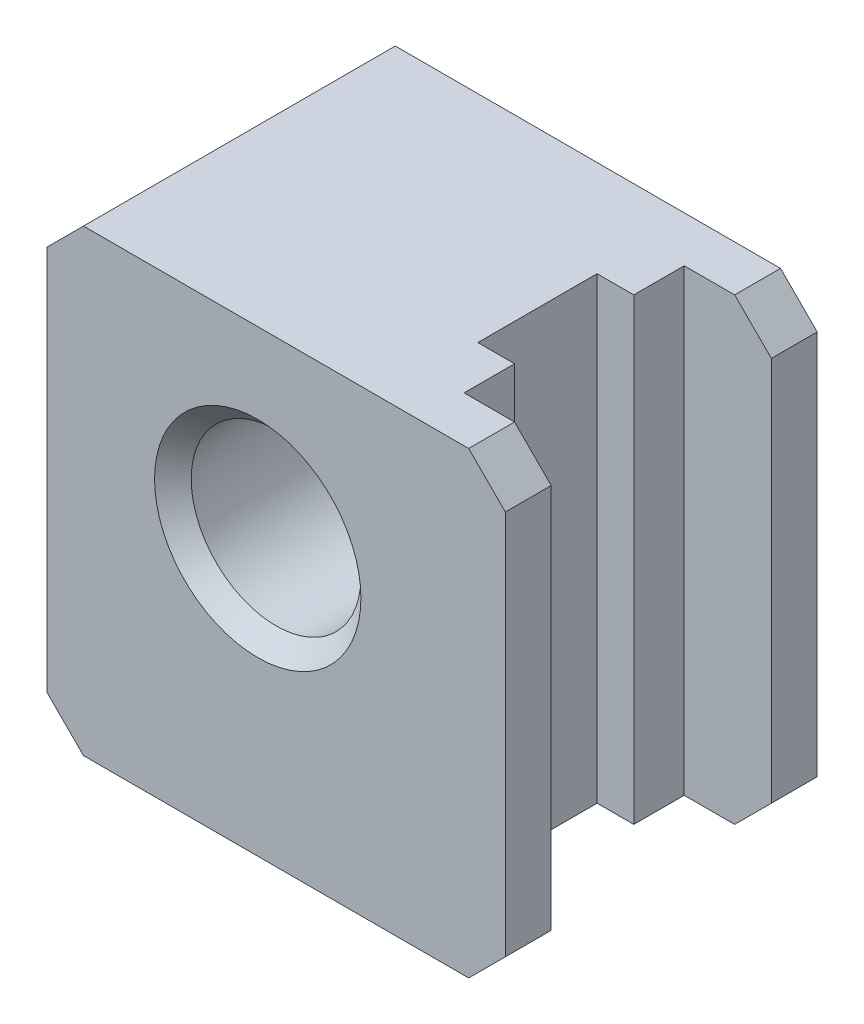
ISO-10303-21;
HEADER;
FILE_DESCRIPTION(('STEP AP214'),'2;1');
FILE_NAME('part.step','',(''),(''),'','','');
FILE_SCHEMA(('AUTOMOTIVE_DESIGN { 1 0 10303 214 1 1 1 1 }'));
ENDSEC;
DATA;
#1=APPLICATION_CONTEXT('core data for automotive mechanical design processes');
#2=APPLICATION_PROTOCOL_DEFINITION('international standard','automotive_design',2000,#1);
#3=PRODUCT_CONTEXT('',#1,'mechanical');
#4=PRODUCT('Part','Part','',(#3));
#5=PRODUCT_RELATED_PRODUCT_CATEGORY('part','',(#4));
#6=PRODUCT_DEFINITION_FORMATION('','',#4);
#7=PRODUCT_DEFINITION_CONTEXT('part definition',#1,'design');
#8=PRODUCT_DEFINITION('design','',#6,#7);
#9=PRODUCT_DEFINITION_SHAPE('','',#8);
#10=(LENGTH_UNIT() NAMED_UNIT(*) SI_UNIT(.MILLI.,.METRE.));
#11=(NAMED_UNIT(*) PLANE_ANGLE_UNIT() SI_UNIT($,.RADIAN.));
#12=(NAMED_UNIT(*) SI_UNIT($,.STERADIAN.) SOLID_ANGLE_UNIT());
#13=UNCERTAINTY_MEASURE_WITH_UNIT(LENGTH_MEASURE(1.E-05),#10,'distance_accuracy_value','');
#14=(GEOMETRIC_REPRESENTATION_CONTEXT(3) GLOBAL_UNCERTAINTY_ASSIGNED_CONTEXT((#13)) GLOBAL_UNIT_ASSIGNED_CONTEXT((#10,
#11,#12)) REPRESENTATION_CONTEXT('',''));
#15=CARTESIAN_POINT('',(0.,0.,0.));
#16=DIRECTION('',(0.,0.,1.));
#17=DIRECTION('',(1.,0.,0.));
#18=AXIS2_PLACEMENT_3D('',#15,#16,#17);
#19=CARTESIAN_POINT('',(15.5,-25.,12.));
#20=DIRECTION('',(1.,0.,0.));
#21=DIRECTION('',(0.,1.,0.));
#22=AXIS2_PLACEMENT_3D('',#19,#20,#21);
#23=PLANE('',#22);
#24=DIRECTION('',(0.,-1.,0.));
#25=VECTOR('',#24,1.);
#26=CARTESIAN_POINT('',(15.5,25.,6.50000000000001));
#27=LINE('',#26,#25);
#28=CARTESIAN_POINT('',(15.5,25.,6.50000000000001));
#29=VERTEX_POINT('',#28);
#30=CARTESIAN_POINT('',(15.5,-25.,6.5));
#31=VERTEX_POINT('',#30);
#32=EDGE_CURVE('E175',#29,#31,#27,.T.);
#33=ORIENTED_EDGE('',*,*,#32,.F.);
#34=DIRECTION('',(0.,0.,1.));
#35=VECTOR('',#34,1.);
#36=CARTESIAN_POINT('',(15.5,25.,12.));
#37=LINE('',#36,#35);
#38=CARTESIAN_POINT('',(15.5,25.,12.));
#39=VERTEX_POINT('',#38);
#40=EDGE_CURVE('E229',#29,#39,#37,.T.);
#41=ORIENTED_EDGE('',*,*,#40,.T.);
#42=DIRECTION('',(0.,-1.,0.));
#43=VECTOR('',#42,1.);
#44=CARTESIAN_POINT('',(15.5,25.,12.));
#45=LINE('',#44,#43);
#46=CARTESIAN_POINT('',(15.5,-25.,12.));
#47=VERTEX_POINT('',#46);
#48=EDGE_CURVE('E217',#39,#47,#45,.T.);
#49=ORIENTED_EDGE('',*,*,#48,.T.);
#50=DIRECTION('',(0.,0.,-1.));
#51=VECTOR('',#50,1.);
#52=CARTESIAN_POINT('',(15.5,-25.,12.));
#53=LINE('',#52,#51);
#54=EDGE_CURVE('E222',#47,#31,#53,.T.);
#55=ORIENTED_EDGE('',*,*,#54,.T.);
#56=EDGE_LOOP('',(#33,#41,#49,#55));
#57=FACE_BOUND('',#56,.T.);
#58=ADVANCED_FACE('F45',(#57),#23,.T.);
#59=CARTESIAN_POINT('',(25.,25.,17.));
#60=DIRECTION('',(-1.,0.,0.));
#61=DIRECTION('',(0.,-1.,0.));
#62=AXIS2_PLACEMENT_3D('',#59,#60,#61);
#63=PLANE('',#62);
#64=DIRECTION('',(0.,0.,-1.));
#65=VECTOR('',#64,1.);
#66=CARTESIAN_POINT('',(25.,-21.,17.));
#67=LINE('',#66,#65);
#68=CARTESIAN_POINT('',(25.,-21.,17.));
#69=VERTEX_POINT('',#68);
#70=CARTESIAN_POINT('',(25.,-21.,12.));
#71=VERTEX_POINT('',#70);
#72=EDGE_CURVE('E312',#69,#71,#67,.T.);
#73=ORIENTED_EDGE('',*,*,#72,.T.);
#74=DIRECTION('',(0.,-1.,0.));
#75=VECTOR('',#74,1.);
#76=CARTESIAN_POINT('',(25.,25.,12.));
#77=LINE('',#76,#75);
#78=CARTESIAN_POINT('',(25.,21.,12.));
#79=VERTEX_POINT('',#78);
#80=EDGE_CURVE('E210',#79,#71,#77,.T.);
#81=ORIENTED_EDGE('',*,*,#80,.F.);
#82=DIRECTION('',(0.,0.,1.));
#83=VECTOR('',#82,1.);
#84=CARTESIAN_POINT('',(25.,21.,17.));
#85=LINE('',#84,#83);
#86=CARTESIAN_POINT('',(25.,21.,17.));
#87=VERTEX_POINT('',#86);
#88=EDGE_CURVE('E306',#79,#87,#85,.T.);
#89=ORIENTED_EDGE('',*,*,#88,.T.);
#90=DIRECTION('',(0.,1.,0.));
#91=VECTOR('',#90,1.);
#92=CARTESIAN_POINT('',(25.,25.,17.));
#93=LINE('',#92,#91);
#94=EDGE_CURVE('E268',#69,#87,#93,.T.);
#95=ORIENTED_EDGE('',*,*,#94,.F.);
#96=EDGE_LOOP('',(#73,#81,#89,#95));
#97=FACE_BOUND('',#96,.T.);
#98=ADVANCED_FACE('F423',(#97),#63,.F.);
#99=CARTESIAN_POINT('',(25.,-21.,17.));
#100=DIRECTION('',(-0.707106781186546,0.707106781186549,0.));
#101=DIRECTION('',(-0.707106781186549,-0.707106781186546,0.));
#102=AXIS2_PLACEMENT_3D('',#99,#100,#101);
#103=PLANE('',#102);
#104=DIRECTION('',(0.707106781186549,0.707106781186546,0.));
#105=VECTOR('',#104,1.);
#106=CARTESIAN_POINT('',(25.,-21.,12.));
#107=LINE('',#106,#105);
#108=CARTESIAN_POINT('',(21.,-25.,12.));
#109=VERTEX_POINT('',#108);
#110=EDGE_CURVE('E255',#71,#109,#107,.F.);
#111=ORIENTED_EDGE('',*,*,#110,.F.);
#112=ORIENTED_EDGE('',*,*,#72,.F.);
#113=DIRECTION('',(-0.707106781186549,-0.707106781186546,0.));
#114=VECTOR('',#113,1.);
#115=CARTESIAN_POINT('',(-2.00000000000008,-48.,17.));
#116=LINE('',#115,#114);
#117=CARTESIAN_POINT('',(21.,-25.,17.));
#118=VERTEX_POINT('',#117);
#119=EDGE_CURVE('E346',#118,#69,#116,.F.);
#120=ORIENTED_EDGE('',*,*,#119,.F.);
#121=DIRECTION('',(0.,0.,1.));
#122=VECTOR('',#121,1.);
#123=CARTESIAN_POINT('',(21.,-25.,17.));
#124=LINE('',#123,#122);
#125=EDGE_CURVE('E332',#109,#118,#124,.T.);
#126=ORIENTED_EDGE('',*,*,#125,.F.);
#127=EDGE_LOOP('',(#111,#112,#120,#126));
#128=FACE_BOUND('',#127,.T.);
#129=ADVANCED_FACE('F418',(#128),#103,.F.);
#130=CARTESIAN_POINT('',(21.,25.,17.));
#131=DIRECTION('',(-0.707106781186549,-0.707106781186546,0.));
#132=DIRECTION('',(0.707106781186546,-0.707106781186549,0.));
#133=AXIS2_PLACEMENT_3D('',#130,#131,#132);
#134=PLANE('',#133);
#135=DIRECTION('',(-0.707106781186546,0.707106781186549,0.));
#136=VECTOR('',#135,1.);
#137=CARTESIAN_POINT('',(21.,25.,12.));
#138=LINE('',#137,#136);
#139=CARTESIAN_POINT('',(21.,25.,12.));
#140=VERTEX_POINT('',#139);
#141=EDGE_CURVE('E11',#140,#79,#138,.F.);
#142=ORIENTED_EDGE('',*,*,#141,.F.);
#143=DIRECTION('',(0.,0.,-1.));
#144=VECTOR('',#143,1.);
#145=CARTESIAN_POINT('',(21.,25.,17.));
#146=LINE('',#145,#144);
#147=CARTESIAN_POINT('',(21.,25.,17.));
#148=VERTEX_POINT('',#147);
#149=EDGE_CURVE('E357',#148,#140,#146,.T.);
#150=ORIENTED_EDGE('',*,*,#149,.F.);
#151=DIRECTION('',(0.707106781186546,-0.707106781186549,0.));
#152=VECTOR('',#151,1.);
#153=CARTESIAN_POINT('',(23.0000000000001,22.9999999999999,17.));
#154=LINE('',#153,#152);
#155=EDGE_CURVE('E337',#87,#148,#154,.F.);
#156=ORIENTED_EDGE('',*,*,#155,.F.);
#157=ORIENTED_EDGE('',*,*,#88,.F.);
#158=EDGE_LOOP('',(#142,#150,#156,#157));
#159=FACE_BOUND('',#158,.T.);
#160=ADVANCED_FACE('F428',(#159),#134,.F.);
#161=CARTESIAN_POINT('',(-25.,25.,17.));
#162=DIRECTION('',(1.,0.,0.));
#163=DIRECTION('',(0.,1.,0.));
#164=AXIS2_PLACEMENT_3D('',#161,#162,#163);
#165=PLANE('',#164);
#166=DIRECTION('',(0.,-1.,0.));
#167=VECTOR('',#166,1.);
#168=CARTESIAN_POINT('',(-25.,25.,-17.));
#169=LINE('',#168,#167);
#170=CARTESIAN_POINT('',(-25.,21.,-17.));
#171=VERTEX_POINT('',#170);
#172=CARTESIAN_POINT('',(-25.,-21.,-17.));
#173=VERTEX_POINT('',#172);
#174=EDGE_CURVE('E258',#171,#173,#169,.T.);
#175=ORIENTED_EDGE('',*,*,#174,.T.);
#176=DIRECTION('',(0.,0.,1.));
#177=VECTOR('',#176,1.);
#178=CARTESIAN_POINT('',(-25.,-21.,17.));
#179=LINE('',#178,#177);
#180=CARTESIAN_POINT('',(-25.,-21.,17.));
#181=VERTEX_POINT('',#180);
#182=EDGE_CURVE('E353',#173,#181,#179,.T.);
#183=ORIENTED_EDGE('',*,*,#182,.T.);
#184=DIRECTION('',(0.,-1.,0.));
#185=VECTOR('',#184,1.);
#186=CARTESIAN_POINT('',(-25.,25.,17.));
#187=LINE('',#186,#185);
#188=CARTESIAN_POINT('',(-25.,21.,17.));
#189=VERTEX_POINT('',#188);
#190=EDGE_CURVE('E259',#189,#181,#187,.T.);
#191=ORIENTED_EDGE('',*,*,#190,.F.);
#192=DIRECTION('',(0.,0.,-1.));
#193=VECTOR('',#192,1.);
#194=CARTESIAN_POINT('',(-25.,21.,17.));
#195=LINE('',#194,#193);
#196=EDGE_CURVE('E349',#189,#171,#195,.T.);
#197=ORIENTED_EDGE('',*,*,#196,.T.);
#198=EDGE_LOOP('',(#175,#183,#191,#197));
#199=FACE_BOUND('',#198,.T.);
#200=ADVANCED_FACE('F408',(#199),#165,.F.);
#201=CARTESIAN_POINT('',(-25.,-25.,17.));
#202=DIRECTION('',(0.,1.,0.));
#203=DIRECTION('',(0.,0.,1.));
#204=AXIS2_PLACEMENT_3D('',#201,#202,#203);
#205=PLANE('',#204);
#206=DIRECTION('',(0.,0.,-1.));
#207=VECTOR('',#206,1.);
#208=CARTESIAN_POINT('',(11.5,-25.,6.5));
#209=LINE('',#208,#207);
#210=CARTESIAN_POINT('',(11.5,-25.,6.5));
#211=VERTEX_POINT('',#210);
#212=CARTESIAN_POINT('',(11.5,-25.,-6.50000000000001));
#213=VERTEX_POINT('',#212);
#214=EDGE_CURVE('E187',#211,#213,#209,.T.);
#215=ORIENTED_EDGE('',*,*,#214,.F.);
#216=DIRECTION('',(1.,0.,0.));
#217=VECTOR('',#216,1.);
#218=CARTESIAN_POINT('',(11.5,-25.,6.5));
#219=LINE('',#218,#217);
#220=EDGE_CURVE('E169',#211,#31,#219,.T.);
#221=ORIENTED_EDGE('',*,*,#220,.T.);
#222=ORIENTED_EDGE('',*,*,#54,.F.);
#223=DIRECTION('',(1.,0.,0.));
#224=VECTOR('',#223,1.);
#225=CARTESIAN_POINT('',(15.5,-25.,12.));
#226=LINE('',#225,#224);
#227=EDGE_CURVE('E234',#47,#109,#226,.T.);
#228=ORIENTED_EDGE('',*,*,#227,.T.);
#229=ORIENTED_EDGE('',*,*,#125,.T.);
#230=DIRECTION('',(1.,0.,0.));
#231=VECTOR('',#230,1.);
#232=CARTESIAN_POINT('',(-25.,-25.,17.));
#233=LINE('',#232,#231);
#234=CARTESIAN_POINT('',(-21.,-25.,17.));
#235=VERTEX_POINT('',#234);
#236=EDGE_CURVE('E263',#235,#118,#233,.T.);
#237=ORIENTED_EDGE('',*,*,#236,.F.);
#238=DIRECTION('',(0.,0.,-1.));
#239=VECTOR('',#238,1.);
#240=CARTESIAN_POINT('',(-21.,-25.,17.));
#241=LINE('',#240,#239);
#242=CARTESIAN_POINT('',(-21.,-25.,-17.));
#243=VERTEX_POINT('',#242);
#244=EDGE_CURVE('E328',#235,#243,#241,.T.);
#245=ORIENTED_EDGE('',*,*,#244,.T.);
#246=DIRECTION('',(1.,0.,0.));
#247=VECTOR('',#246,1.);
#248=CARTESIAN_POINT('',(-25.,-25.,-17.));
#249=LINE('',#248,#247);
#250=CARTESIAN_POINT('',(21.,-25.,-17.));
#251=VERTEX_POINT('',#250);
#252=EDGE_CURVE('E280',#243,#251,#249,.T.);
#253=ORIENTED_EDGE('',*,*,#252,.T.);
#254=CARTESIAN_POINT('',(21.,-25.,-12.));
#255=VERTEX_POINT('',#254);
#256=EDGE_CURVE('E333',#251,#255,#124,.T.);
#257=ORIENTED_EDGE('',*,*,#256,.T.);
#258=DIRECTION('',(1.,0.,0.));
#259=VECTOR('',#258,1.);
#260=CARTESIAN_POINT('',(15.5,-25.,-12.));
#261=LINE('',#260,#259);
#262=CARTESIAN_POINT('',(15.5,-25.,-12.));
#263=VERTEX_POINT('',#262);
#264=EDGE_CURVE('E247',#263,#255,#261,.T.);
#265=ORIENTED_EDGE('',*,*,#264,.F.);
#266=CARTESIAN_POINT('',(15.5,-25.,-6.50000000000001));
#267=VERTEX_POINT('',#266);
#268=EDGE_CURVE('E221',#267,#263,#53,.T.);
#269=ORIENTED_EDGE('',*,*,#268,.F.);
#270=DIRECTION('',(1.,0.,0.));
#271=VECTOR('',#270,1.);
#272=CARTESIAN_POINT('',(11.5,-25.,-6.50000000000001));
#273=LINE('',#272,#271);
#274=EDGE_CURVE('E61',#213,#267,#273,.T.);
#275=ORIENTED_EDGE('',*,*,#274,.F.);
#276=EDGE_LOOP('',(#215,#221,#222,#228,#229,#237,#245,#253,#257,#265,#269,#275));
#277=FACE_BOUND('',#276,.T.);
#278=ADVANCED_FACE('F193',(#277),#205,.F.);
#279=CARTESIAN_POINT('',(25.,21.,-17.));
#280=VERTEX_POINT('',#279);
#281=CARTESIAN_POINT('',(25.,21.,-12.));
#282=VERTEX_POINT('',#281);
#283=EDGE_CURVE('E307',#280,#282,#85,.T.);
#284=ORIENTED_EDGE('',*,*,#283,.T.);
#285=DIRECTION('',(0.,1.,0.));
#286=VECTOR('',#285,1.);
#287=CARTESIAN_POINT('',(25.,25.,-12.));
#288=LINE('',#287,#286);
#289=CARTESIAN_POINT('',(25.,-21.,-12.));
#290=VERTEX_POINT('',#289);
#291=EDGE_CURVE('E69',#290,#282,#288,.T.);
#292=ORIENTED_EDGE('',*,*,#291,.F.);
#293=CARTESIAN_POINT('',(25.,-21.,-17.));
#294=VERTEX_POINT('',#293);
#295=EDGE_CURVE('E311',#290,#294,#67,.T.);
#296=ORIENTED_EDGE('',*,*,#295,.T.);
#297=DIRECTION('',(0.,1.,0.));
#298=VECTOR('',#297,1.);
#299=CARTESIAN_POINT('',(25.,25.,-17.));
#300=LINE('',#299,#298);
#301=EDGE_CURVE('E284',#294,#280,#300,.T.);
#302=ORIENTED_EDGE('',*,*,#301,.T.);
#303=EDGE_LOOP('',(#284,#292,#296,#302));
#304=FACE_BOUND('',#303,.T.);
#305=ADVANCED_FACE('F393',(#304),#63,.F.);
#306=CARTESIAN_POINT('',(-25.,25.,17.));
#307=DIRECTION('',(0.,-1.,0.));
#308=DIRECTION('',(0.,0.,-1.));
#309=AXIS2_PLACEMENT_3D('',#306,#307,#308);
#310=PLANE('',#309);
#311=ORIENTED_EDGE('',*,*,#40,.F.);
#312=DIRECTION('',(1.,0.,0.));
#313=VECTOR('',#312,1.);
#314=CARTESIAN_POINT('',(11.5,25.,6.50000000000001));
#315=LINE('',#314,#313);
#316=CARTESIAN_POINT('',(11.5,25.,6.50000000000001));
#317=VERTEX_POINT('',#316);
#318=EDGE_CURVE('E207',#317,#29,#315,.T.);
#319=ORIENTED_EDGE('',*,*,#318,.F.);
#320=DIRECTION('',(0.,0.,1.));
#321=VECTOR('',#320,1.);
#322=CARTESIAN_POINT('',(11.5,25.,6.50000000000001));
#323=LINE('',#322,#321);
#324=CARTESIAN_POINT('',(11.5,25.,-6.5));
#325=VERTEX_POINT('',#324);
#326=EDGE_CURVE('E181',#325,#317,#323,.T.);
#327=ORIENTED_EDGE('',*,*,#326,.F.);
#328=DIRECTION('',(1.,0.,0.));
#329=VECTOR('',#328,1.);
#330=CARTESIAN_POINT('',(11.5,25.,-6.5));
#331=LINE('',#330,#329);
#332=CARTESIAN_POINT('',(15.5,25.,-6.5));
#333=VERTEX_POINT('',#332);
#334=EDGE_CURVE('E211',#325,#333,#331,.T.);
#335=ORIENTED_EDGE('',*,*,#334,.T.);
#336=CARTESIAN_POINT('',(15.5,25.,-12.));
#337=VERTEX_POINT('',#336);
#338=EDGE_CURVE('E230',#337,#333,#37,.T.);
#339=ORIENTED_EDGE('',*,*,#338,.F.);
#340=DIRECTION('',(1.,0.,0.));
#341=VECTOR('',#340,1.);
#342=CARTESIAN_POINT('',(15.5,25.,-12.));
#343=LINE('',#342,#341);
#344=CARTESIAN_POINT('',(21.,25.,-12.));
#345=VERTEX_POINT('',#344);
#346=EDGE_CURVE('E243',#337,#345,#343,.T.);
#347=ORIENTED_EDGE('',*,*,#346,.T.);
#348=CARTESIAN_POINT('',(21.,25.,-17.));
#349=VERTEX_POINT('',#348);
#350=EDGE_CURVE('E356',#345,#349,#146,.T.);
#351=ORIENTED_EDGE('',*,*,#350,.T.);
#352=DIRECTION('',(-1.,0.,0.));
#353=VECTOR('',#352,1.);
#354=CARTESIAN_POINT('',(-25.,25.,-17.));
#355=LINE('',#354,#353);
#356=CARTESIAN_POINT('',(-21.,25.,-17.));
#357=VERTEX_POINT('',#356);
#358=EDGE_CURVE('E264',#349,#357,#355,.T.);
#359=ORIENTED_EDGE('',*,*,#358,.T.);
#360=DIRECTION('',(0.,0.,1.));
#361=VECTOR('',#360,1.);
#362=CARTESIAN_POINT('',(-21.,25.,17.));
#363=LINE('',#362,#361);
#364=CARTESIAN_POINT('',(-21.,25.,17.));
#365=VERTEX_POINT('',#364);
#366=EDGE_CURVE('E361',#357,#365,#363,.T.);
#367=ORIENTED_EDGE('',*,*,#366,.T.);
#368=DIRECTION('',(-1.,0.,0.));
#369=VECTOR('',#368,1.);
#370=CARTESIAN_POINT('',(-25.,25.,17.));
#371=LINE('',#370,#369);
#372=EDGE_CURVE('E272',#148,#365,#371,.T.);
#373=ORIENTED_EDGE('',*,*,#372,.F.);
#374=ORIENTED_EDGE('',*,*,#149,.T.);
#375=DIRECTION('',(1.,0.,0.));
#376=VECTOR('',#375,1.);
#377=CARTESIAN_POINT('',(15.5,25.,12.));
#378=LINE('',#377,#376);
#379=EDGE_CURVE('E239',#39,#140,#378,.T.);
#380=ORIENTED_EDGE('',*,*,#379,.F.);
#381=EDGE_LOOP('',(#311,#319,#327,#335,#339,#347,#351,#359,#367,#373,#374,#380));
#382=FACE_BOUND('',#381,.T.);
#383=ADVANCED_FACE('F372',(#382),#310,.F.);
#384=CARTESIAN_POINT('',(-25.,-25.,17.));
#385=DIRECTION('',(0.,0.,1.));
#386=DIRECTION('',(1.,0.,0.));
#387=AXIS2_PLACEMENT_3D('',#384,#385,#386);
#388=PLANE('',#387);
#389=CARTESIAN_POINT('',(-1.99999999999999,5.,17.));
#390=DIRECTION('',(0.,0.,1.));
#391=DIRECTION('',(1.,0.,0.));
#392=AXIS2_PLACEMENT_3D('',#389,#390,#391);
#393=CIRCLE('',#392,11.25);
#394=CARTESIAN_POINT('',(9.25000000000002,5.,17.));
#395=VERTEX_POINT('',#394);
#396=EDGE_CURVE('E298',#395,#395,#393,.F.);
#397=ORIENTED_EDGE('',*,*,#396,.T.);
#398=EDGE_LOOP('',(#397));
#399=FACE_BOUND('',#398,.T.);
#400=ORIENTED_EDGE('',*,*,#236,.T.);
#401=ORIENTED_EDGE('',*,*,#119,.T.);
#402=ORIENTED_EDGE('',*,*,#94,.T.);
#403=ORIENTED_EDGE('',*,*,#155,.T.);
#404=ORIENTED_EDGE('',*,*,#372,.T.);
#405=DIRECTION('',(0.707106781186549,0.707106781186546,0.));
#406=VECTOR('',#405,1.);
#407=CARTESIAN_POINT('',(-48.,-1.9999999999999,17.));
#408=LINE('',#407,#406);
#409=EDGE_CURVE('E340',#365,#189,#408,.F.);
#410=ORIENTED_EDGE('',*,*,#409,.T.);
#411=ORIENTED_EDGE('',*,*,#190,.T.);
#412=DIRECTION('',(-0.707106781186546,0.707106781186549,0.));
#413=VECTOR('',#412,1.);
#414=CARTESIAN_POINT('',(-23.,-23.,17.));
#415=LINE('',#414,#413);
#416=EDGE_CURVE('E343',#181,#235,#415,.F.);
#417=ORIENTED_EDGE('',*,*,#416,.T.);
#418=EDGE_LOOP('',(#400,#401,#402,#403,#404,#410,#411,#417));
#419=FACE_BOUND('',#418,.T.);
#420=ADVANCED_FACE('F405',(#399,#419),#388,.T.);
#421=CARTESIAN_POINT('',(-25.,-25.,-17.));
#422=DIRECTION('',(0.,0.,1.));
#423=DIRECTION('',(1.,0.,0.));
#424=AXIS2_PLACEMENT_3D('',#421,#422,#423);
#425=PLANE('',#424);
#426=CARTESIAN_POINT('',(-1.99999999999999,5.,-17.));
#427=DIRECTION('',(0.,0.,1.));
#428=DIRECTION('',(1.,0.,0.));
#429=AXIS2_PLACEMENT_3D('',#426,#427,#428);
#430=CIRCLE('',#429,11.25);
#431=CARTESIAN_POINT('',(9.24999999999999,5.,-17.));
#432=VERTEX_POINT('',#431);
#433=EDGE_CURVE('E302',#432,#432,#430,.T.);
#434=ORIENTED_EDGE('',*,*,#433,.T.);
#435=EDGE_LOOP('',(#434));
#436=FACE_BOUND('',#435,.T.);
#437=ORIENTED_EDGE('',*,*,#301,.F.);
#438=DIRECTION('',(0.707106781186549,0.707106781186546,0.));
#439=VECTOR('',#438,1.);
#440=CARTESIAN_POINT('',(25.,-21.,-17.));
#441=LINE('',#440,#439);
#442=EDGE_CURVE('E325',#294,#251,#441,.F.);
#443=ORIENTED_EDGE('',*,*,#442,.T.);
#444=ORIENTED_EDGE('',*,*,#252,.F.);
#445=DIRECTION('',(0.707106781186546,-0.707106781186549,0.));
#446=VECTOR('',#445,1.);
#447=CARTESIAN_POINT('',(-21.,-25.,-17.));
#448=LINE('',#447,#446);
#449=EDGE_CURVE('E322',#243,#173,#448,.F.);
#450=ORIENTED_EDGE('',*,*,#449,.T.);
#451=ORIENTED_EDGE('',*,*,#174,.F.);
#452=DIRECTION('',(-0.707106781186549,-0.707106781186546,0.));
#453=VECTOR('',#452,1.);
#454=CARTESIAN_POINT('',(-25.,21.,-17.));
#455=LINE('',#454,#453);
#456=EDGE_CURVE('E319',#171,#357,#455,.F.);
#457=ORIENTED_EDGE('',*,*,#456,.T.);
#458=ORIENTED_EDGE('',*,*,#358,.F.);
#459=DIRECTION('',(-0.707106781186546,0.707106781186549,0.));
#460=VECTOR('',#459,1.);
#461=CARTESIAN_POINT('',(21.,25.,-17.));
#462=LINE('',#461,#460);
#463=EDGE_CURVE('E316',#349,#280,#462,.F.);
#464=ORIENTED_EDGE('',*,*,#463,.T.);
#465=EDGE_LOOP('',(#437,#443,#444,#450,#451,#457,#458,#464));
#466=FACE_BOUND('',#465,.T.);
#467=ADVANCED_FACE('F395',(#436,#466),#425,.F.);
#468=CARTESIAN_POINT('',(-1.99999999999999,5.,17.));
#469=DIRECTION('',(0.,0.,1.));
#470=DIRECTION('',(1.,0.,0.));
#471=AXIS2_PLACEMENT_3D('',#468,#469,#470);
#472=CYLINDRICAL_SURFACE('',#471,9.24999999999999);
#473=CARTESIAN_POINT('',(-1.99999999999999,5.,15.));
#474=DIRECTION('',(0.,0.,1.));
#475=DIRECTION('',(1.,0.,0.));
#476=AXIS2_PLACEMENT_3D('',#473,#474,#475);
#477=CIRCLE('',#476,9.24999999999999);
#478=CARTESIAN_POINT('',(7.25,5.,15.));
#479=VERTEX_POINT('',#478);
#480=EDGE_CURVE('E294',#479,#479,#477,.T.);
#481=ORIENTED_EDGE('',*,*,#480,.T.);
#482=EDGE_LOOP('',(#481));
#483=FACE_BOUND('',#482,.T.);
#484=CARTESIAN_POINT('',(-1.99999999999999,5.,-15.));
#485=DIRECTION('',(0.,0.,1.));
#486=DIRECTION('',(1.,0.,0.));
#487=AXIS2_PLACEMENT_3D('',#484,#485,#486);
#488=CIRCLE('',#487,9.24999999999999);
#489=CARTESIAN_POINT('',(7.25,5.,-15.));
#490=VERTEX_POINT('',#489);
#491=EDGE_CURVE('E276',#490,#490,#488,.F.);
#492=ORIENTED_EDGE('',*,*,#491,.T.);
#493=EDGE_LOOP('',(#492));
#494=FACE_BOUND('',#493,.T.);
#495=ADVANCED_FACE('F454',(#483,#494),#472,.F.);
#496=CARTESIAN_POINT('',(-1.99999999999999,5.,15.));
#497=DIRECTION('',(0.,0.,1.));
#498=DIRECTION('',(1.,0.,0.));
#499=AXIS2_PLACEMENT_3D('',#496,#497,#498);
#500=CONICAL_SURFACE('',#499,9.24999999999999,0.785398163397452);
#501=ORIENTED_EDGE('',*,*,#396,.F.);
#502=EDGE_LOOP('',(#501));
#503=FACE_BOUND('',#502,.T.);
#504=ORIENTED_EDGE('',*,*,#480,.F.);
#505=EDGE_LOOP('',(#504));
#506=FACE_BOUND('',#505,.T.);
#507=ADVANCED_FACE('F457',(#503,#506),#500,.F.);
#508=CARTESIAN_POINT('',(-1.99999999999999,5.,-17.));
#509=DIRECTION('',(0.,0.,-1.));
#510=DIRECTION('',(-1.,0.,0.));
#511=AXIS2_PLACEMENT_3D('',#508,#509,#510);
#512=CONICAL_SURFACE('',#511,11.25,0.785398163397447);
#513=ORIENTED_EDGE('',*,*,#491,.F.);
#514=EDGE_LOOP('',(#513));
#515=FACE_BOUND('',#514,.T.);
#516=ORIENTED_EDGE('',*,*,#433,.F.);
#517=EDGE_LOOP('',(#516));
#518=FACE_BOUND('',#517,.T.);
#519=ADVANCED_FACE('F474',(#515,#518),#512,.F.);
#520=DIRECTION('',(-0.707106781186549,-0.707106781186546,0.));
#521=VECTOR('',#520,1.);
#522=CARTESIAN_POINT('',(25.,-21.,-12.));
#523=LINE('',#522,#521);
#524=EDGE_CURVE('E242',#255,#290,#523,.F.);
#525=ORIENTED_EDGE('',*,*,#524,.F.);
#526=ORIENTED_EDGE('',*,*,#256,.F.);
#527=ORIENTED_EDGE('',*,*,#442,.F.);
#528=ORIENTED_EDGE('',*,*,#295,.F.);
#529=EDGE_LOOP('',(#525,#526,#527,#528));
#530=FACE_BOUND('',#529,.T.);
#531=ADVANCED_FACE('F389',(#530),#103,.F.);
#532=CARTESIAN_POINT('',(-21.,-25.,17.));
#533=DIRECTION('',(0.707106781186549,0.707106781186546,0.));
#534=DIRECTION('',(-0.707106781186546,0.707106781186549,0.));
#535=AXIS2_PLACEMENT_3D('',#532,#533,#534);
#536=PLANE('',#535);
#537=ORIENTED_EDGE('',*,*,#416,.F.);
#538=ORIENTED_EDGE('',*,*,#182,.F.);
#539=ORIENTED_EDGE('',*,*,#449,.F.);
#540=ORIENTED_EDGE('',*,*,#244,.F.);
#541=EDGE_LOOP('',(#537,#538,#539,#540));
#542=FACE_BOUND('',#541,.T.);
#543=ADVANCED_FACE('F411',(#542),#536,.F.);
#544=CARTESIAN_POINT('',(-25.,21.,17.));
#545=DIRECTION('',(0.707106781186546,-0.707106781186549,0.));
#546=DIRECTION('',(0.707106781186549,0.707106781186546,0.));
#547=AXIS2_PLACEMENT_3D('',#544,#545,#546);
#548=PLANE('',#547);
#549=ORIENTED_EDGE('',*,*,#409,.F.);
#550=ORIENTED_EDGE('',*,*,#366,.F.);
#551=ORIENTED_EDGE('',*,*,#456,.F.);
#552=ORIENTED_EDGE('',*,*,#196,.F.);
#553=EDGE_LOOP('',(#549,#550,#551,#552));
#554=FACE_BOUND('',#553,.T.);
#555=ADVANCED_FACE('F401',(#554),#548,.F.);
#556=DIRECTION('',(0.707106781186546,-0.707106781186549,0.));
#557=VECTOR('',#556,1.);
#558=CARTESIAN_POINT('',(21.,25.,-12.));
#559=LINE('',#558,#557);
#560=EDGE_CURVE('E54',#282,#345,#559,.F.);
#561=ORIENTED_EDGE('',*,*,#560,.F.);
#562=ORIENTED_EDGE('',*,*,#283,.F.);
#563=ORIENTED_EDGE('',*,*,#463,.F.);
#564=ORIENTED_EDGE('',*,*,#350,.F.);
#565=EDGE_LOOP('',(#561,#562,#563,#564));
#566=FACE_BOUND('',#565,.T.);
#567=ADVANCED_FACE('F47',(#566),#134,.F.);
#568=CARTESIAN_POINT('',(15.5,25.,12.));
#569=DIRECTION('',(0.,0.,1.));
#570=DIRECTION('',(0.,-1.,0.));
#571=AXIS2_PLACEMENT_3D('',#568,#569,#570);
#572=PLANE('',#571);
#573=ORIENTED_EDGE('',*,*,#110,.T.);
#574=ORIENTED_EDGE('',*,*,#227,.F.);
#575=ORIENTED_EDGE('',*,*,#48,.F.);
#576=ORIENTED_EDGE('',*,*,#379,.T.);
#577=ORIENTED_EDGE('',*,*,#141,.T.);
#578=ORIENTED_EDGE('',*,*,#80,.T.);
#579=EDGE_LOOP('',(#573,#574,#575,#576,#577,#578));
#580=FACE_BOUND('',#579,.T.);
#581=ADVANCED_FACE('F433',(#580),#572,.F.);
#582=CARTESIAN_POINT('',(15.5,25.,-12.));
#583=DIRECTION('',(0.,0.,-1.));
#584=DIRECTION('',(0.,1.,0.));
#585=AXIS2_PLACEMENT_3D('',#582,#583,#584);
#586=PLANE('',#585);
#587=ORIENTED_EDGE('',*,*,#524,.T.);
#588=ORIENTED_EDGE('',*,*,#291,.T.);
#589=ORIENTED_EDGE('',*,*,#560,.T.);
#590=ORIENTED_EDGE('',*,*,#346,.F.);
#591=DIRECTION('',(0.,1.,0.));
#592=VECTOR('',#591,1.);
#593=CARTESIAN_POINT('',(15.5,25.,-12.));
#594=LINE('',#593,#592);
#595=EDGE_CURVE('E225',#263,#337,#594,.T.);
#596=ORIENTED_EDGE('',*,*,#595,.F.);
#597=ORIENTED_EDGE('',*,*,#264,.T.);
#598=EDGE_LOOP('',(#587,#588,#589,#590,#596,#597));
#599=FACE_BOUND('',#598,.T.);
#600=ADVANCED_FACE('F364',(#599),#586,.F.);
#601=DIRECTION('',(0.,1.,0.));
#602=VECTOR('',#601,1.);
#603=CARTESIAN_POINT('',(15.5,25.,-6.5));
#604=LINE('',#603,#602);
#605=EDGE_CURVE('E191',#267,#333,#604,.T.);
#606=ORIENTED_EDGE('',*,*,#605,.F.);
#607=ORIENTED_EDGE('',*,*,#268,.T.);
#608=ORIENTED_EDGE('',*,*,#595,.T.);
#609=ORIENTED_EDGE('',*,*,#338,.T.);
#610=EDGE_LOOP('',(#606,#607,#608,#609));
#611=FACE_BOUND('',#610,.T.);
#612=ADVANCED_FACE('F382',(#611),#23,.T.);
#613=CARTESIAN_POINT('',(11.5,25.,6.50000000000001));
#614=DIRECTION('',(0.,0.,1.));
#615=DIRECTION('',(0.,-1.,0.));
#616=AXIS2_PLACEMENT_3D('',#613,#614,#615);
#617=PLANE('',#616);
#618=ORIENTED_EDGE('',*,*,#32,.T.);
#619=ORIENTED_EDGE('',*,*,#220,.F.);
#620=DIRECTION('',(0.,-1.,0.));
#621=VECTOR('',#620,1.);
#622=CARTESIAN_POINT('',(11.5,25.,6.50000000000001));
#623=LINE('',#622,#621);
#624=EDGE_CURVE('E172',#317,#211,#623,.T.);
#625=ORIENTED_EDGE('',*,*,#624,.F.);
#626=ORIENTED_EDGE('',*,*,#318,.T.);
#627=EDGE_LOOP('',(#618,#619,#625,#626));
#628=FACE_BOUND('',#627,.T.);
#629=ADVANCED_FACE('F171',(#628),#617,.F.);
#630=CARTESIAN_POINT('',(11.5,25.,-6.5));
#631=DIRECTION('',(0.,0.,-1.));
#632=DIRECTION('',(0.,1.,0.));
#633=AXIS2_PLACEMENT_3D('',#630,#631,#632);
#634=PLANE('',#633);
#635=ORIENTED_EDGE('',*,*,#605,.T.);
#636=ORIENTED_EDGE('',*,*,#334,.F.);
#637=DIRECTION('',(0.,1.,0.));
#638=VECTOR('',#637,1.);
#639=CARTESIAN_POINT('',(11.5,25.,-6.5));
#640=LINE('',#639,#638);
#641=EDGE_CURVE('E196',#213,#325,#640,.T.);
#642=ORIENTED_EDGE('',*,*,#641,.F.);
#643=ORIENTED_EDGE('',*,*,#274,.T.);
#644=EDGE_LOOP('',(#635,#636,#642,#643));
#645=FACE_BOUND('',#644,.T.);
#646=ADVANCED_FACE('F448',(#645),#634,.F.);
#647=CARTESIAN_POINT('',(11.5,-25.,6.5));
#648=DIRECTION('',(1.,0.,0.));
#649=DIRECTION('',(0.,1.,0.));
#650=AXIS2_PLACEMENT_3D('',#647,#648,#649);
#651=PLANE('',#650);
#652=ORIENTED_EDGE('',*,*,#624,.T.);
#653=ORIENTED_EDGE('',*,*,#214,.T.);
#654=ORIENTED_EDGE('',*,*,#641,.T.);
#655=ORIENTED_EDGE('',*,*,#326,.T.);
#656=EDGE_LOOP('',(#652,#653,#654,#655));
#657=FACE_BOUND('',#656,.T.);
#658=ADVANCED_FACE('F185',(#657),#651,.T.);
#659=CLOSED_SHELL('',(#58,#98,#129,#160,#200,#278,#305,#383,#420,#467,#495,#507,#519,#531,#543,
#555,#567,#581,#600,#612,#629,#646,#658));
#660=MANIFOLD_SOLID_BREP('B2',#659);
#661=ADVANCED_BREP_SHAPE_REPRESENTATION('',(#18,#660),#14);
#662=SHAPE_DEFINITION_REPRESENTATION(#9,#661);
ENDSEC;
END-ISO-10303-21;
